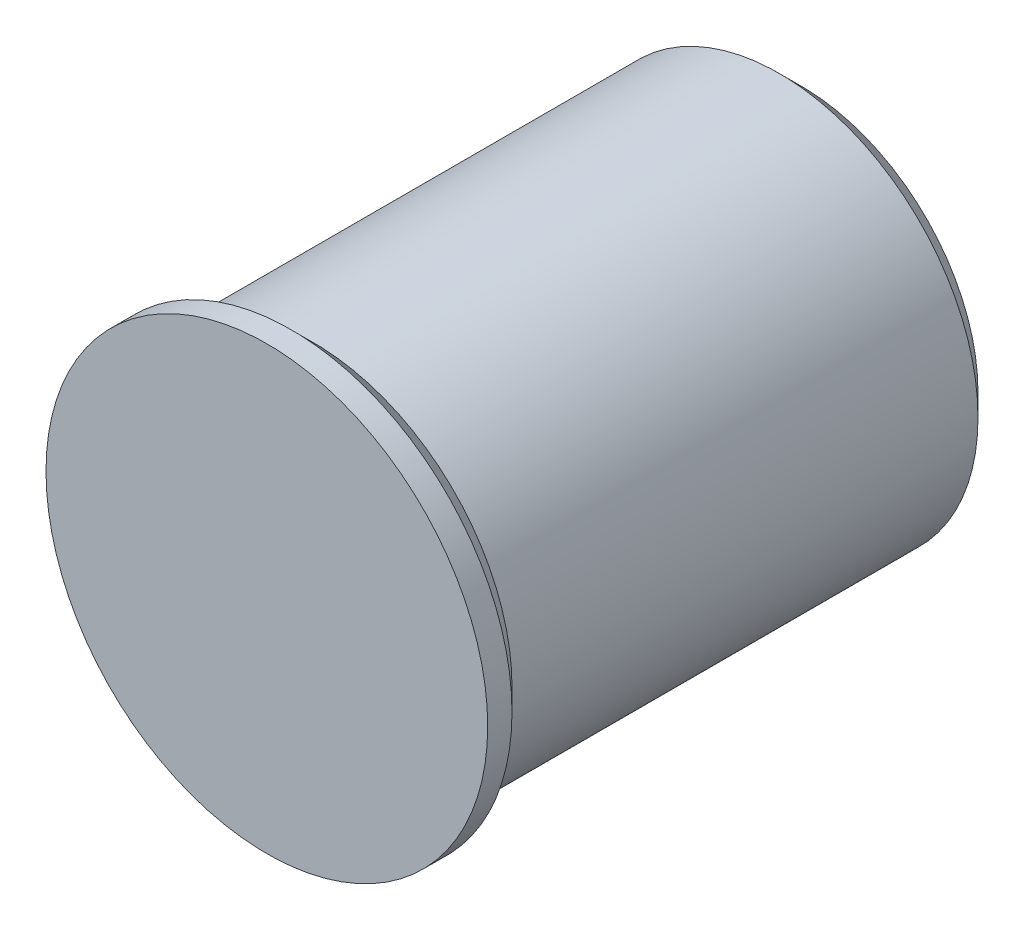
ISO-10303-21;
HEADER;
FILE_DESCRIPTION(('STEP AP214'),'2;1');
FILE_NAME('part.step','',(''),(''),'','','');
FILE_SCHEMA(('AUTOMOTIVE_DESIGN { 1 0 10303 214 1 1 1 1 }'));
ENDSEC;
DATA;
#1=APPLICATION_CONTEXT('core data for automotive mechanical design processes');
#2=APPLICATION_PROTOCOL_DEFINITION('international standard','automotive_design',2000,#1);
#3=PRODUCT_CONTEXT('',#1,'mechanical');
#4=PRODUCT('Part','Part','',(#3));
#5=PRODUCT_RELATED_PRODUCT_CATEGORY('part','',(#4));
#6=PRODUCT_DEFINITION_FORMATION('','',#4);
#7=PRODUCT_DEFINITION_CONTEXT('part definition',#1,'design');
#8=PRODUCT_DEFINITION('design','',#6,#7);
#9=PRODUCT_DEFINITION_SHAPE('','',#8);
#10=(LENGTH_UNIT() NAMED_UNIT(*) SI_UNIT(.MILLI.,.METRE.));
#11=(NAMED_UNIT(*) PLANE_ANGLE_UNIT() SI_UNIT($,.RADIAN.));
#12=(NAMED_UNIT(*) SI_UNIT($,.STERADIAN.) SOLID_ANGLE_UNIT());
#13=UNCERTAINTY_MEASURE_WITH_UNIT(LENGTH_MEASURE(1.E-05),#10,'distance_accuracy_value','');
#14=(GEOMETRIC_REPRESENTATION_CONTEXT(3) GLOBAL_UNCERTAINTY_ASSIGNED_CONTEXT((#13)) GLOBAL_UNIT_ASSIGNED_CONTEXT((#10,
#11,#12)) REPRESENTATION_CONTEXT('',''));
#15=CARTESIAN_POINT('',(0.,0.,0.));
#16=DIRECTION('',(0.,0.,1.));
#17=DIRECTION('',(1.,0.,0.));
#18=AXIS2_PLACEMENT_3D('',#15,#16,#17);
#19=CARTESIAN_POINT('',(0.,0.,6.1468));
#20=DIRECTION('',(0.,0.,-1.));
#21=DIRECTION('',(-1.,0.,0.));
#22=AXIS2_PLACEMENT_3D('',#19,#20,#21);
#23=CYLINDRICAL_SURFACE('',#22,2.54);
#24=CARTESIAN_POINT('',(0.,0.,5.8674));
#25=DIRECTION('',(0.,0.,-1.));
#26=DIRECTION('',(-1.,0.,0.));
#27=AXIS2_PLACEMENT_3D('',#24,#25,#26);
#28=CIRCLE('',#27,2.54);
#29=CARTESIAN_POINT('',(-2.54,0.,5.8674));
#30=VERTEX_POINT('',#29);
#31=EDGE_CURVE('E35',#30,#30,#28,.T.);
#32=ORIENTED_EDGE('',*,*,#31,.F.);
#33=EDGE_LOOP('',(#32));
#34=FACE_BOUND('',#33,.T.);
#35=CARTESIAN_POINT('',(0.,0.,6.1468));
#36=DIRECTION('',(0.,0.,1.));
#37=DIRECTION('',(1.,0.,0.));
#38=AXIS2_PLACEMENT_3D('',#35,#36,#37);
#39=CIRCLE('',#38,2.54);
#40=CARTESIAN_POINT('',(2.54,0.,6.1468));
#41=VERTEX_POINT('',#40);
#42=EDGE_CURVE('E29',#41,#41,#39,.T.);
#43=ORIENTED_EDGE('',*,*,#42,.F.);
#44=EDGE_LOOP('',(#43));
#45=FACE_BOUND('',#44,.T.);
#46=ADVANCED_FACE('F14',(#34,#45),#23,.T.);
#47=CARTESIAN_POINT('',(0.,0.,6.1468));
#48=DIRECTION('',(0.,0.,1.));
#49=DIRECTION('',(1.,0.,0.));
#50=AXIS2_PLACEMENT_3D('',#47,#48,#49);
#51=PLANE('',#50);
#52=ORIENTED_EDGE('',*,*,#42,.T.);
#53=EDGE_LOOP('',(#52));
#54=FACE_BOUND('',#53,.T.);
#55=ADVANCED_FACE('F52',(#54),#51,.T.);
#56=CARTESIAN_POINT('',(0.,0.,5.8674));
#57=DIRECTION('',(0.,0.,1.));
#58=DIRECTION('',(1.,0.,0.));
#59=AXIS2_PLACEMENT_3D('',#56,#57,#58);
#60=CONICAL_SURFACE('',#59,2.54,0.785398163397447);
#61=CARTESIAN_POINT('',(0.,0.,5.6134));
#62=DIRECTION('',(0.,0.,-1.));
#63=DIRECTION('',(-1.,0.,0.));
#64=AXIS2_PLACEMENT_3D('',#61,#62,#63);
#65=CIRCLE('',#64,2.286);
#66=CARTESIAN_POINT('',(-2.286,0.,5.6134));
#67=VERTEX_POINT('',#66);
#68=EDGE_CURVE('E41',#67,#67,#65,.T.);
#69=ORIENTED_EDGE('',*,*,#68,.F.);
#70=EDGE_LOOP('',(#69));
#71=FACE_BOUND('',#70,.T.);
#72=ORIENTED_EDGE('',*,*,#31,.T.);
#73=EDGE_LOOP('',(#72));
#74=FACE_BOUND('',#73,.T.);
#75=ADVANCED_FACE('F49',(#71,#74),#60,.T.);
#76=CARTESIAN_POINT('',(0.,0.,0.));
#77=DIRECTION('',(0.,0.,-1.));
#78=DIRECTION('',(-1.,0.,0.));
#79=AXIS2_PLACEMENT_3D('',#76,#77,#78);
#80=CYLINDRICAL_SURFACE('',#79,2.286);
#81=CARTESIAN_POINT('',(0.,0.,0.253999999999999));
#82=DIRECTION('',(0.,0.,1.));
#83=DIRECTION('',(1.,0.,0.));
#84=AXIS2_PLACEMENT_3D('',#81,#82,#83);
#85=CIRCLE('',#84,2.286);
#86=CARTESIAN_POINT('',(2.286,0.,0.253999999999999));
#87=VERTEX_POINT('',#86);
#88=EDGE_CURVE('E9',#87,#87,#85,.T.);
#89=ORIENTED_EDGE('',*,*,#88,.T.);
#90=EDGE_LOOP('',(#89));
#91=FACE_BOUND('',#90,.T.);
#92=ORIENTED_EDGE('',*,*,#68,.T.);
#93=EDGE_LOOP('',(#92));
#94=FACE_BOUND('',#93,.T.);
#95=ADVANCED_FACE('F47',(#91,#94),#80,.T.);
#96=CARTESIAN_POINT('',(0.,0.,0.));
#97=DIRECTION('',(0.,0.,1.));
#98=DIRECTION('',(1.,0.,0.));
#99=AXIS2_PLACEMENT_3D('',#96,#97,#98);
#100=PLANE('',#99);
#101=CARTESIAN_POINT('',(0.,0.,0.));
#102=DIRECTION('',(0.,0.,1.));
#103=DIRECTION('',(1.,0.,0.));
#104=AXIS2_PLACEMENT_3D('',#101,#102,#103);
#105=CIRCLE('',#104,2.032);
#106=CARTESIAN_POINT('',(2.032,0.,0.));
#107=VERTEX_POINT('',#106);
#108=EDGE_CURVE('E22',#107,#107,#105,.F.);
#109=ORIENTED_EDGE('',*,*,#108,.T.);
#110=EDGE_LOOP('',(#109));
#111=FACE_BOUND('',#110,.T.);
#112=ADVANCED_FACE('F67',(#111),#100,.F.);
#113=CARTESIAN_POINT('',(0.,0.,0.));
#114=DIRECTION('',(0.,0.,1.));
#115=DIRECTION('',(1.,0.,0.));
#116=AXIS2_PLACEMENT_3D('',#113,#114,#115);
#117=CONICAL_SURFACE('',#116,2.032,0.785398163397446);
#118=ORIENTED_EDGE('',*,*,#88,.F.);
#119=EDGE_LOOP('',(#118));
#120=FACE_BOUND('',#119,.T.);
#121=ORIENTED_EDGE('',*,*,#108,.F.);
#122=EDGE_LOOP('',(#121));
#123=FACE_BOUND('',#122,.T.);
#124=ADVANCED_FACE('F16',(#120,#123),#117,.T.);
#125=CLOSED_SHELL('',(#46,#55,#75,#95,#112,#124));
#126=MANIFOLD_SOLID_BREP('B1',#125);
#127=ADVANCED_BREP_SHAPE_REPRESENTATION('',(#18,#126),#14);
#128=SHAPE_DEFINITION_REPRESENTATION(#9,#127);
ENDSEC;
END-ISO-10303-21;
